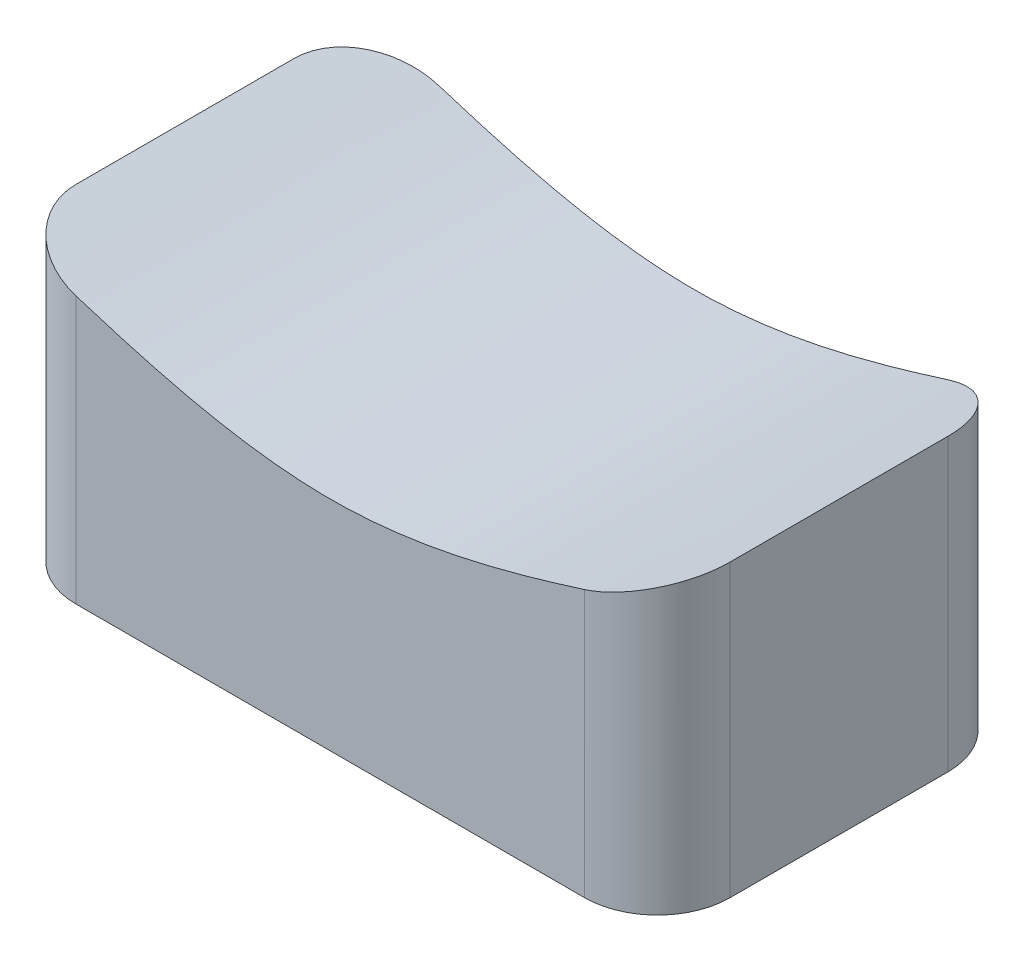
ISO-10303-21;
HEADER;
FILE_DESCRIPTION(('STEP AP214'),'2;1');
FILE_NAME('part.step','',(''),(''),'','','');
FILE_SCHEMA(('AUTOMOTIVE_DESIGN { 1 0 10303 214 1 1 1 1 }'));
ENDSEC;
DATA;
#1=APPLICATION_CONTEXT('core data for automotive mechanical design processes');
#2=APPLICATION_PROTOCOL_DEFINITION('international standard','automotive_design',2000,#1);
#3=PRODUCT_CONTEXT('',#1,'mechanical');
#4=PRODUCT('Part','Part','',(#3));
#5=PRODUCT_RELATED_PRODUCT_CATEGORY('part','',(#4));
#6=PRODUCT_DEFINITION_FORMATION('','',#4);
#7=PRODUCT_DEFINITION_CONTEXT('part definition',#1,'design');
#8=PRODUCT_DEFINITION('design','',#6,#7);
#9=PRODUCT_DEFINITION_SHAPE('','',#8);
#10=(LENGTH_UNIT() NAMED_UNIT(*) SI_UNIT(.MILLI.,.METRE.));
#11=(NAMED_UNIT(*) PLANE_ANGLE_UNIT() SI_UNIT($,.RADIAN.));
#12=(NAMED_UNIT(*) SI_UNIT($,.STERADIAN.) SOLID_ANGLE_UNIT());
#13=UNCERTAINTY_MEASURE_WITH_UNIT(LENGTH_MEASURE(1.E-05),#10,'distance_accuracy_value','');
#14=(GEOMETRIC_REPRESENTATION_CONTEXT(3) GLOBAL_UNCERTAINTY_ASSIGNED_CONTEXT((#13)) GLOBAL_UNIT_ASSIGNED_CONTEXT((#10,
#11,#12)) REPRESENTATION_CONTEXT('',''));
#15=CARTESIAN_POINT('',(0.,0.,0.));
#16=DIRECTION('',(0.,0.,1.));
#17=DIRECTION('',(1.,0.,0.));
#18=AXIS2_PLACEMENT_3D('',#15,#16,#17);
#19=CARTESIAN_POINT('',(-68.2385416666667,-80.,-29.9937499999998));
#20=DIRECTION('',(0.,1.,0.));
#21=DIRECTION('',(0.,0.,1.));
#22=AXIS2_PLACEMENT_3D('',#19,#20,#21);
#23=CYLINDRICAL_SURFACE('',#22,20.);
#24=DIRECTION('',(0.,1.,0.));
#25=VECTOR('',#24,1.);
#26=CARTESIAN_POINT('',(-88.2385416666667,-80.,-29.9937499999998));
#27=LINE('',#26,#25);
#28=CARTESIAN_POINT('',(-88.2385416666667,-80.,-29.9937499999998));
#29=VERTEX_POINT('',#28);
#30=CARTESIAN_POINT('',(-88.2385416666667,0.,-29.9937499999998));
#31=VERTEX_POINT('',#30);
#32=EDGE_CURVE('E35',#29,#31,#27,.T.);
#33=ORIENTED_EDGE('',*,*,#32,.T.);
#34=CARTESIAN_POINT('',(-88.2385416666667,0.,-29.9937499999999));
#35=CARTESIAN_POINT('',(-88.2385564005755,4.91846261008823E-06,-30.3548959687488));
#36=CARTESIAN_POINT('',(-88.2287602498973,-0.00326047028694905,-30.716039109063));
#37=CARTESIAN_POINT('',(-88.1896554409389,-0.0162954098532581,-31.43709464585));
#38=CARTESIAN_POINT('',(-88.1603497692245,-0.0260639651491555,-31.7970072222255));
#39=CARTESIAN_POINT('',(-88.0823371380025,-0.0520681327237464,-32.5144692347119));
#40=CARTESIAN_POINT('',(-88.0336311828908,-0.0683034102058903,-32.8720187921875));
#41=CARTESIAN_POINT('',(-87.9171535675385,-0.107128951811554,-33.5828529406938));
#42=CARTESIAN_POINT('',(-87.8494232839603,-0.129705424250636,-33.9361450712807));
#43=CARTESIAN_POINT('',(-87.6951293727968,-0.181135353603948,-34.6381378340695));
#44=CARTESIAN_POINT('',(-87.6085655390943,-0.209988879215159,-34.9868384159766));
#45=CARTESIAN_POINT('',(-87.4169688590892,-0.273850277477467,-35.6785321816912));
#46=CARTESIAN_POINT('',(-87.311936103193,-0.308858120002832,-36.0215253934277));
#47=CARTESIAN_POINT('',(-87.0268009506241,-0.403890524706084,-36.8705142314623));
#48=CARTESIAN_POINT('',(-86.835408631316,-0.467675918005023,-37.3723426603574));
#49=CARTESIAN_POINT('',(-86.4136331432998,-0.608222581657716,-38.3575546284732));
#50=CARTESIAN_POINT('',(-86.1832438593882,-0.684985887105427,-38.8409352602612));
#51=CARTESIAN_POINT('',(-85.8099565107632,-0.809333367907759,-39.5497313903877));
#52=CARTESIAN_POINT('',(-85.6808776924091,-0.852327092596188,-39.783335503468));
#53=CARTESIAN_POINT('',(-85.4137823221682,-0.941279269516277,-40.2447080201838));
#54=CARTESIAN_POINT('',(-85.2757683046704,-0.987236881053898,-40.4724780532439));
#55=CARTESIAN_POINT('',(-84.8486479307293,-1.12944097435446,-41.1466570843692));
#56=CARTESIAN_POINT('',(-84.5464492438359,-1.23002338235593,-41.5839615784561));
#57=CARTESIAN_POINT('',(-83.9027230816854,-1.44417268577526,-42.4407109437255));
#58=CARTESIAN_POINT('',(-83.5604820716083,-1.55797477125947,-42.8595589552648));
#59=CARTESIAN_POINT('',(-82.8448276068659,-1.79577938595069,-43.6666159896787));
#60=CARTESIAN_POINT('',(-82.4714137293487,-1.9197820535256,-44.0548245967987));
#61=CARTESIAN_POINT('',(-81.696128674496,-2.17700182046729,-44.798545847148));
#62=CARTESIAN_POINT('',(-81.2942512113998,-2.31022095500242,-45.1540512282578));
#63=CARTESIAN_POINT('',(-80.4649671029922,-2.58480086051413,-45.8304429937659));
#64=CARTESIAN_POINT('',(-80.0375599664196,-2.72616178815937,-46.1513287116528));
#65=CARTESIAN_POINT('',(-79.1385037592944,-3.02308545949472,-46.7718203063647));
#66=CARTESIAN_POINT('',(-78.6657125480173,-3.17900475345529,-47.0696015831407));
#67=CARTESIAN_POINT('',(-77.6985539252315,-3.4973658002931,-47.6238049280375));
#68=CARTESIAN_POINT('',(-77.2041850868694,-3.65980798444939,-47.8802242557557));
#69=CARTESIAN_POINT('',(-76.1972427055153,-3.98993912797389,-48.3504346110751));
#70=CARTESIAN_POINT('',(-75.6846681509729,-4.15762837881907,-48.5642232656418));
#71=CARTESIAN_POINT('',(-74.6447398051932,-4.49695617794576,-48.9481098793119));
#72=CARTESIAN_POINT('',(-74.1173878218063,-4.66859424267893,-49.1182131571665));
#73=CARTESIAN_POINT('',(-73.1489181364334,-4.98285888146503,-49.386853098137));
#74=CARTESIAN_POINT('',(-72.7096914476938,-5.12504296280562,-49.4927908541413));
#75=CARTESIAN_POINT('',(-71.8254614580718,-5.41050471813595,-49.6746468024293));
#76=CARTESIAN_POINT('',(-71.3804588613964,-5.55378225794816,-49.750568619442));
#77=CARTESIAN_POINT('',(-70.4870850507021,-5.84056350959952,-49.8720538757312));
#78=CARTESIAN_POINT('',(-70.0387192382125,-5.98406664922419,-49.9176584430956));
#79=CARTESIAN_POINT('',(-69.1398000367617,-6.27084179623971,-49.9785153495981));
#80=CARTESIAN_POINT('',(-68.6892463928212,-6.41411377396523,-49.9937640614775));
#81=CARTESIAN_POINT('',(-68.2385416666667,-6.55692729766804,-49.9937499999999));
#82=B_SPLINE_CURVE_WITH_KNOTS('',3,(#34,#35,#36,#37,#38,#39,#40,#41,#42,#43,#44,#45,#46,#47,#48,
#49,#50,#51,#52,#53,#54,#55,#56,#57,#58,#59,#60,#61,#62,#63,#64,#65,#66,#67,#68,#69,#70,#71,#72,
#73,#74,#75,#76,#77,#78,#79,#80,#81),.UNSPECIFIED.,.F.,.F.,(4,2,2,2,2,2,2,2,2,2,2,2,2,2,2,2,2,2,
2,2,2,2,2,4),(0.,1.0832858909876,2.16640598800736,3.24947001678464,4.33019645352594,
5.41093471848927,6.49166769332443,8.11228700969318,9.73316069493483,10.5439659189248,
11.3545421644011,12.9756037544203,14.6319911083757,16.2884009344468,17.945177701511,
19.6019863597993,21.3403376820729,23.0788041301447,24.8173673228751,26.5557187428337,
27.9757664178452,29.395642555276,30.8135885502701,32.231703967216),.UNSPECIFIED.);
#83=CARTESIAN_POINT('',(-68.2385416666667,-6.55692729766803,-49.9937499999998));
#84=VERTEX_POINT('',#83);
#85=EDGE_CURVE('E48',#31,#84,#82,.T.);
#86=ORIENTED_EDGE('',*,*,#85,.T.);
#87=DIRECTION('',(0.,1.,0.));
#88=VECTOR('',#87,1.);
#89=CARTESIAN_POINT('',(-68.2385416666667,-80.,-49.9937499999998));
#90=LINE('',#89,#88);
#91=CARTESIAN_POINT('',(-68.2385416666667,-80.,-49.9937499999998));
#92=VERTEX_POINT('',#91);
#93=EDGE_CURVE('E11',#92,#84,#90,.T.);
#94=ORIENTED_EDGE('',*,*,#93,.F.);
#95=CARTESIAN_POINT('',(-68.2385416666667,-80.,-29.9937499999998));
#96=DIRECTION('',(0.,1.,0.));
#97=DIRECTION('',(0.,0.,1.));
#98=AXIS2_PLACEMENT_3D('',#95,#96,#97);
#99=CIRCLE('',#98,20.);
#100=EDGE_CURVE('E118',#92,#29,#99,.T.);
#101=ORIENTED_EDGE('',*,*,#100,.T.);
#102=EDGE_LOOP('',(#33,#86,#94,#101));
#103=FACE_BOUND('',#102,.T.);
#104=ADVANCED_FACE('F31',(#103),#23,.T.);
#105=CARTESIAN_POINT('',(-68.2385416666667,-80.,-49.9937499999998));
#106=DIRECTION('',(0.,0.,-1.));
#107=DIRECTION('',(-1.,0.,0.));
#108=AXIS2_PLACEMENT_3D('',#105,#106,#107);
#109=PLANE('',#108);
#110=ORIENTED_EDGE('',*,*,#93,.T.);
#111=CARTESIAN_POINT('',(-88.2385416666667,0.,-49.9937499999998));
#112=CARTESIAN_POINT('',(-58.2385416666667,-10.,-49.9937499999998));
#113=CARTESIAN_POINT('',(1.76145833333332,-30.,-49.9937499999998));
#114=CARTESIAN_POINT('',(61.7614583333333,-10.,-49.9937499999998));
#115=CARTESIAN_POINT('',(91.7614583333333,0.,-49.9937499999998));
#116=B_SPLINE_CURVE_WITH_KNOTS('',3,(#111,#112,#113,#114,#115),.UNSPECIFIED.,.F.,.F.,(4,1,4),
(0.,0.5,1.),.UNSPECIFIED.);
#117=CARTESIAN_POINT('',(71.7614583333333,-6.55692729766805,-49.9937499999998));
#118=VERTEX_POINT('',#117);
#119=EDGE_CURVE('E54',#84,#118,#116,.T.);
#120=ORIENTED_EDGE('',*,*,#119,.T.);
#121=DIRECTION('',(0.,1.,0.));
#122=VECTOR('',#121,1.);
#123=CARTESIAN_POINT('',(71.7614583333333,-80.,-49.9937499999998));
#124=LINE('',#123,#122);
#125=CARTESIAN_POINT('',(71.7614583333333,-80.,-49.9937499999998));
#126=VERTEX_POINT('',#125);
#127=EDGE_CURVE('E40',#126,#118,#124,.T.);
#128=ORIENTED_EDGE('',*,*,#127,.F.);
#129=DIRECTION('',(-1.,0.,0.));
#130=VECTOR('',#129,1.);
#131=CARTESIAN_POINT('',(-68.2385416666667,-80.,-49.9937499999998));
#132=LINE('',#131,#130);
#133=EDGE_CURVE('E140',#126,#92,#132,.T.);
#134=ORIENTED_EDGE('',*,*,#133,.T.);
#135=EDGE_LOOP('',(#110,#120,#128,#134));
#136=FACE_BOUND('',#135,.T.);
#137=ADVANCED_FACE('F205',(#136),#109,.T.);
#138=CARTESIAN_POINT('',(71.7614583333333,-80.,-29.9937499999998));
#139=DIRECTION('',(0.,1.,0.));
#140=DIRECTION('',(0.,0.,1.));
#141=AXIS2_PLACEMENT_3D('',#138,#139,#140);
#142=CYLINDRICAL_SURFACE('',#141,20.);
#143=ORIENTED_EDGE('',*,*,#127,.T.);
#144=CARTESIAN_POINT('',(71.7614583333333,-6.55692729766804,-49.9937499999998));
#145=CARTESIAN_POINT('',(72.1521054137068,-6.43314339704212,-49.9937581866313));
#146=CARTESIAN_POINT('',(72.5426411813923,-6.30901519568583,-49.9823049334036));
#147=CARTESIAN_POINT('',(73.3223001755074,-6.06050316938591,-49.9365727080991));
#148=CARTESIAN_POINT('',(73.7114233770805,-5.93611934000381,-49.9022933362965));
#149=CARTESIAN_POINT('',(74.4870567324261,-5.68753238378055,-49.811005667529));
#150=CARTESIAN_POINT('',(74.8735668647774,-5.5633292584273,-49.7539971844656));
#151=CARTESIAN_POINT('',(75.6430422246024,-5.31546184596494,-49.6173607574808));
#152=CARTESIAN_POINT('',(76.0260048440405,-5.19179798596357,-49.5377173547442));
#153=CARTESIAN_POINT('',(76.7869245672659,-4.94554107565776,-49.3560246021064));
#154=CARTESIAN_POINT('',(77.164881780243,-4.82294800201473,-49.2539757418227));
#155=CARTESIAN_POINT('',(77.914584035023,-4.57928732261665,-49.0277297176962));
#156=CARTESIAN_POINT('',(78.286329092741,-4.45821971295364,-48.9035326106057));
#157=CARTESIAN_POINT('',(79.2069141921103,-4.15786626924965,-48.5655428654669));
#158=CARTESIAN_POINT('',(79.7511769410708,-3.9797990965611,-48.3380353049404));
#159=CARTESIAN_POINT('',(80.8191146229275,-3.62960827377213,-47.8349176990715));
#160=CARTESIAN_POINT('',(81.3427873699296,-3.45748525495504,-47.5593025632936));
#161=CARTESIAN_POINT('',(82.1095446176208,-3.20499669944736,-47.1111324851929));
#162=CARTESIAN_POINT('',(82.361984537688,-3.12178995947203,-46.9559657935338));
#163=CARTESIAN_POINT('',(82.8601190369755,-2.95746151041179,-46.6342913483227));
#164=CARTESIAN_POINT('',(83.1058154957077,-2.87633922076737,-46.467786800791));
#165=CARTESIAN_POINT('',(83.8321771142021,-2.636334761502,-45.9515227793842));
#166=CARTESIAN_POINT('',(84.3021781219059,-2.48079404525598,-45.5849757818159));
#167=CARTESIAN_POINT('',(85.199362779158,-2.18354457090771,-44.8181658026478));
#168=CARTESIAN_POINT('',(85.6272640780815,-2.0416057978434,-44.4188290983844));
#169=CARTESIAN_POINT('',(86.4481412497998,-1.76908678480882,-43.5821567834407));
#170=CARTESIAN_POINT('',(86.8411171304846,-1.6385065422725,-43.1448211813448));
#171=CARTESIAN_POINT('',(87.5886592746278,-1.38996178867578,-42.2349221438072));
#172=CARTESIAN_POINT('',(87.9432214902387,-1.27199860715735,-41.7623550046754));
#173=CARTESIAN_POINT('',(88.4435291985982,-1.10547920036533,-41.0298738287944));
#174=CARTESIAN_POINT('',(88.6050457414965,-1.05170921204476,-40.7817692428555));
#175=CARTESIAN_POINT('',(88.9172672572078,-0.947751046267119,-40.2780122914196));
#176=CARTESIAN_POINT('',(89.0679691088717,-0.897563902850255,-40.0223577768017));
#177=CARTESIAN_POINT('',(89.4886049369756,-0.757464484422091,-39.270946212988));
#178=CARTESIAN_POINT('',(89.7439119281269,-0.67240703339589,-38.7659851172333));
#179=CARTESIAN_POINT('',(90.2114740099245,-0.516614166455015,-37.7343941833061));
#180=CARTESIAN_POINT('',(90.4237315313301,-0.445877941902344,-37.2077655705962));
#181=CARTESIAN_POINT('',(90.7081659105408,-0.351081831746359,-36.4049021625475));
#182=CARTESIAN_POINT('',(90.7972922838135,-0.321376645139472,-36.1352287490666));
#183=CARTESIAN_POINT('',(90.9640574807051,-0.265793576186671,-35.5920427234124));
#184=CARTESIAN_POINT('',(91.041699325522,-0.239914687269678,-35.3185311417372));
#185=CARTESIAN_POINT('',(91.257074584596,-0.168126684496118,-34.4930971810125));
#186=CARTESIAN_POINT('',(91.3773551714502,-0.1280337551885,-33.936000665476));
#187=CARTESIAN_POINT('',(91.5693530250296,-0.0640350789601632,-32.8164587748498));
#188=CARTESIAN_POINT('',(91.6413921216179,-0.0400220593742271,-32.2540747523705));
#189=CARTESIAN_POINT('',(91.7134248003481,-0.0160111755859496,-31.4076630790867));
#190=CARTESIAN_POINT('',(91.7314313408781,-0.0100089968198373,-31.1252328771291));
#191=CARTESIAN_POINT('',(91.7554489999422,-0.00200311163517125,-30.5597969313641));
#192=CARTESIAN_POINT('',(91.7614597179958,4.61289972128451E-07,-30.2767911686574));
#193=CARTESIAN_POINT('',(91.7614583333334,0.,-29.9937499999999));
#194=B_SPLINE_CURVE_WITH_KNOTS('',3,(#144,#145,#146,#147,#148,#149,#150,#151,#152,#153,#154,
#155,#156,#157,#158,#159,#160,#161,#162,#163,#164,#165,#166,#167,#168,#169,#170,#171,#172,#173,
#174,#175,#176,#177,#178,#179,#180,#181,#182,#183,#184,#185,#186,#187,#188,#189,#190,#191,#192,
#193),.UNSPECIFIED.,.F.,.F.,(4,2,2,2,2,2,2,2,2,2,2,2,2,2,2,2,2,2,2,2,2,2,2,2,4),(0.,
1.22920602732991,2.45843358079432,3.68767119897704,4.91775036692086,6.14780265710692,
7.3778517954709,9.22411462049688,11.0705729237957,11.9936462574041,12.9164596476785,
14.7618574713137,16.5663933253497,18.3709287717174,20.1756541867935,21.0780570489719,
21.9807193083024,23.6949896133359,25.4091630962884,26.2656226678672,27.1218565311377,
28.833446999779,30.5335021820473,31.3824559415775,32.2314380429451),.UNSPECIFIED.);
#195=CARTESIAN_POINT('',(91.7614583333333,0.,-29.9937499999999));
#196=VERTEX_POINT('',#195);
#197=EDGE_CURVE('E111',#118,#196,#194,.T.);
#198=ORIENTED_EDGE('',*,*,#197,.T.);
#199=DIRECTION('',(0.,1.,0.));
#200=VECTOR('',#199,1.);
#201=CARTESIAN_POINT('',(91.7614583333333,-80.,-29.9937499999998));
#202=LINE('',#201,#200);
#203=CARTESIAN_POINT('',(91.7614583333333,-80.,-29.9937499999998));
#204=VERTEX_POINT('',#203);
#205=EDGE_CURVE('E97',#204,#196,#202,.T.);
#206=ORIENTED_EDGE('',*,*,#205,.F.);
#207=CARTESIAN_POINT('',(71.7614583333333,-80.,-29.9937499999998));
#208=DIRECTION('',(0.,1.,0.));
#209=DIRECTION('',(0.,0.,-1.));
#210=AXIS2_PLACEMENT_3D('',#207,#208,#209);
#211=CIRCLE('',#210,20.);
#212=EDGE_CURVE('E142',#204,#126,#211,.T.);
#213=ORIENTED_EDGE('',*,*,#212,.T.);
#214=EDGE_LOOP('',(#143,#198,#206,#213));
#215=FACE_BOUND('',#214,.T.);
#216=ADVANCED_FACE('F112',(#215),#142,.T.);
#217=CARTESIAN_POINT('',(71.7614583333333,-80.,30.00625));
#218=DIRECTION('',(0.,1.,0.));
#219=DIRECTION('',(0.,0.,1.));
#220=AXIS2_PLACEMENT_3D('',#217,#218,#219);
#221=CYLINDRICAL_SURFACE('',#220,20.);
#222=DIRECTION('',(0.,1.,0.));
#223=VECTOR('',#222,1.);
#224=CARTESIAN_POINT('',(91.7614583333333,-80.,30.00625));
#225=LINE('',#224,#223);
#226=CARTESIAN_POINT('',(91.7614583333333,-80.,30.00625));
#227=VERTEX_POINT('',#226);
#228=CARTESIAN_POINT('',(91.7614583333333,0.,30.00625));
#229=VERTEX_POINT('',#228);
#230=EDGE_CURVE('E108',#227,#229,#225,.T.);
#231=ORIENTED_EDGE('',*,*,#230,.T.);
#232=CARTESIAN_POINT('',(91.7614583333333,0.,30.00625));
#233=CARTESIAN_POINT('',(91.7614730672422,4.91846260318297E-06,30.367395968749));
#234=CARTESIAN_POINT('',(91.751676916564,-0.00326047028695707,30.7285391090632));
#235=CARTESIAN_POINT('',(91.7125721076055,-0.0162954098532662,31.4495946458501));
#236=CARTESIAN_POINT('',(91.6832664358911,-0.0260639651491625,31.8095072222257));
#237=CARTESIAN_POINT('',(91.6052538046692,-0.0520681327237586,32.5269692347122));
#238=CARTESIAN_POINT('',(91.5565478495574,-0.0683034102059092,32.8845187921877));
#239=CARTESIAN_POINT('',(91.4400702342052,-0.10712895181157,33.595352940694));
#240=CARTESIAN_POINT('',(91.372339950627,-0.129705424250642,33.9486450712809));
#241=CARTESIAN_POINT('',(91.2180460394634,-0.181135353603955,34.6506378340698));
#242=CARTESIAN_POINT('',(91.1314822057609,-0.209988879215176,34.9993384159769));
#243=CARTESIAN_POINT('',(90.9398855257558,-0.273850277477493,35.6910321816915));
#244=CARTESIAN_POINT('',(90.8348527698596,-0.308858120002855,36.034025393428));
#245=CARTESIAN_POINT('',(90.5497176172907,-0.403890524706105,36.8830142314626));
#246=CARTESIAN_POINT('',(90.3583252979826,-0.467675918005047,37.3848426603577));
#247=CARTESIAN_POINT('',(89.9365498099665,-0.60822258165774,38.3700546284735));
#248=CARTESIAN_POINT('',(89.7061605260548,-0.684985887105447,38.8534352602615));
#249=CARTESIAN_POINT('',(89.3328731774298,-0.809333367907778,39.562231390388));
#250=CARTESIAN_POINT('',(89.2037943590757,-0.852327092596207,39.7958355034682));
#251=CARTESIAN_POINT('',(88.9366989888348,-0.941279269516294,40.2572080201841));
#252=CARTESIAN_POINT('',(88.798684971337,-0.987236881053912,40.4849780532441));
#253=CARTESIAN_POINT('',(88.3715645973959,-1.12944097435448,41.1591570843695));
#254=CARTESIAN_POINT('',(88.0693659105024,-1.23002338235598,41.5964615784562));
#255=CARTESIAN_POINT('',(87.4256397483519,-1.44417268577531,42.4532109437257));
#256=CARTESIAN_POINT('',(87.0833987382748,-1.55797477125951,42.872058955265));
#257=CARTESIAN_POINT('',(86.3677442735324,-1.79577938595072,43.679115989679));
#258=CARTESIAN_POINT('',(85.9943303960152,-1.91978205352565,44.067324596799));
#259=CARTESIAN_POINT('',(85.2190453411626,-2.17700182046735,44.8110458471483));
#260=CARTESIAN_POINT('',(84.8171678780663,-2.31022095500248,45.1665512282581));
#261=CARTESIAN_POINT('',(83.9878837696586,-2.5848008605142,45.8429429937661));
#262=CARTESIAN_POINT('',(83.5604766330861,-2.72616178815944,46.163828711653));
#263=CARTESIAN_POINT('',(82.6614204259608,-3.0230854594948,46.7843203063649));
#264=CARTESIAN_POINT('',(82.1886292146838,-3.17900475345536,47.082101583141));
#265=CARTESIAN_POINT('',(81.221470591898,-3.49736580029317,47.6363049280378));
#266=CARTESIAN_POINT('',(80.7271017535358,-3.65980798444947,47.892724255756));
#267=CARTESIAN_POINT('',(79.7201593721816,-3.98993912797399,48.3629346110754));
#268=CARTESIAN_POINT('',(79.2075848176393,-4.15762837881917,48.576723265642));
#269=CARTESIAN_POINT('',(78.1676564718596,-4.49695617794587,48.9606098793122));
#270=CARTESIAN_POINT('',(77.6403044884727,-4.66859424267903,49.1307131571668));
#271=CARTESIAN_POINT('',(76.6718348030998,-4.98285888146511,49.3993530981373));
#272=CARTESIAN_POINT('',(76.2326081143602,-5.1250429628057,49.5052908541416));
#273=CARTESIAN_POINT('',(75.3483781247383,-5.41050471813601,49.6871468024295));
#274=CARTESIAN_POINT('',(74.9033755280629,-5.55378225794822,49.7630686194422));
#275=CARTESIAN_POINT('',(74.0100017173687,-5.84056350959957,49.8845538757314));
#276=CARTESIAN_POINT('',(73.5616359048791,-5.98406664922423,49.9301584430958));
#277=CARTESIAN_POINT('',(72.6627167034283,-6.27084179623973,49.9910153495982));
#278=CARTESIAN_POINT('',(72.2121630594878,-6.41411377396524,50.0062640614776));
#279=CARTESIAN_POINT('',(71.7614583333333,-6.55692729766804,50.00625));
#280=B_SPLINE_CURVE_WITH_KNOTS('',3,(#232,#233,#234,#235,#236,#237,#238,#239,#240,#241,#242,
#243,#244,#245,#246,#247,#248,#249,#250,#251,#252,#253,#254,#255,#256,#257,#258,#259,#260,#261,
#262,#263,#264,#265,#266,#267,#268,#269,#270,#271,#272,#273,#274,#275,#276,#277,#278,#279),
.UNSPECIFIED.,.F.,.F.,(4,2,2,2,2,2,2,2,2,2,2,2,2,2,2,2,2,2,2,2,2,2,2,4),(0.,1.08328589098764,
2.16640598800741,3.24947001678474,4.33019645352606,5.41093471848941,6.4916676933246,
8.11228700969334,9.73316069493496,10.543965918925,11.3545421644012,12.9756037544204,
14.6319911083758,16.2884009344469,17.9451777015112,19.6019863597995,21.3403376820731,
23.078804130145,24.8173673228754,26.555718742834,27.9757664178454,29.3956425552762,
30.8135885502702,32.231703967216),.UNSPECIFIED.);
#281=CARTESIAN_POINT('',(71.7614583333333,-6.55692729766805,50.00625));
#282=VERTEX_POINT('',#281);
#283=EDGE_CURVE('E114',#229,#282,#280,.T.);
#284=ORIENTED_EDGE('',*,*,#283,.T.);
#285=DIRECTION('',(0.,1.,0.));
#286=VECTOR('',#285,1.);
#287=CARTESIAN_POINT('',(71.7614583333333,-80.,50.00625));
#288=LINE('',#287,#286);
#289=CARTESIAN_POINT('',(71.7614583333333,-80.,50.00625));
#290=VERTEX_POINT('',#289);
#291=EDGE_CURVE('E130',#290,#282,#288,.T.);
#292=ORIENTED_EDGE('',*,*,#291,.F.);
#293=CARTESIAN_POINT('',(71.7614583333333,-80.,30.00625));
#294=DIRECTION('',(0.,1.,0.));
#295=DIRECTION('',(0.,0.,1.));
#296=AXIS2_PLACEMENT_3D('',#293,#294,#295);
#297=CIRCLE('',#296,20.);
#298=EDGE_CURVE('E147',#290,#227,#297,.T.);
#299=ORIENTED_EDGE('',*,*,#298,.T.);
#300=EDGE_LOOP('',(#231,#284,#292,#299));
#301=FACE_BOUND('',#300,.T.);
#302=ADVANCED_FACE('F212',(#301),#221,.T.);
#303=CARTESIAN_POINT('',(-68.2385416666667,-80.,50.00625));
#304=DIRECTION('',(0.,0.,1.));
#305=DIRECTION('',(1.,0.,0.));
#306=AXIS2_PLACEMENT_3D('',#303,#304,#305);
#307=PLANE('',#306);
#308=ORIENTED_EDGE('',*,*,#291,.T.);
#309=CARTESIAN_POINT('',(-88.2385416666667,0.,50.00625));
#310=CARTESIAN_POINT('',(-58.2385416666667,-10.,50.00625));
#311=CARTESIAN_POINT('',(1.76145833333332,-30.,50.00625));
#312=CARTESIAN_POINT('',(61.7614583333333,-10.,50.00625));
#313=CARTESIAN_POINT('',(91.7614583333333,0.,50.00625));
#314=B_SPLINE_CURVE_WITH_KNOTS('',3,(#309,#310,#311,#312,#313),.UNSPECIFIED.,.F.,.F.,(4,1,4),
(0.,0.5,1.),.UNSPECIFIED.);
#315=CARTESIAN_POINT('',(-68.2385416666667,-6.55692729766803,50.00625));
#316=VERTEX_POINT('',#315);
#317=EDGE_CURVE('E185',#282,#316,#314,.F.);
#318=ORIENTED_EDGE('',*,*,#317,.T.);
#319=DIRECTION('',(0.,1.,0.));
#320=VECTOR('',#319,1.);
#321=CARTESIAN_POINT('',(-68.2385416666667,-80.,50.00625));
#322=LINE('',#321,#320);
#323=CARTESIAN_POINT('',(-68.2385416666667,-80.,50.00625));
#324=VERTEX_POINT('',#323);
#325=EDGE_CURVE('E133',#324,#316,#322,.T.);
#326=ORIENTED_EDGE('',*,*,#325,.F.);
#327=DIRECTION('',(1.,0.,0.));
#328=VECTOR('',#327,1.);
#329=CARTESIAN_POINT('',(-68.2385416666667,-80.,50.00625));
#330=LINE('',#329,#328);
#331=EDGE_CURVE('E150',#324,#290,#330,.T.);
#332=ORIENTED_EDGE('',*,*,#331,.T.);
#333=EDGE_LOOP('',(#308,#318,#326,#332));
#334=FACE_BOUND('',#333,.T.);
#335=ADVANCED_FACE('F193',(#334),#307,.T.);
#336=CARTESIAN_POINT('',(-68.2385416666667,-80.,30.00625));
#337=DIRECTION('',(0.,1.,0.));
#338=DIRECTION('',(0.,0.,1.));
#339=AXIS2_PLACEMENT_3D('',#336,#337,#338);
#340=CYLINDRICAL_SURFACE('',#339,20.);
#341=ORIENTED_EDGE('',*,*,#325,.T.);
#342=CARTESIAN_POINT('',(-68.2385416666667,-6.55692729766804,50.00625));
#343=CARTESIAN_POINT('',(-68.6291887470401,-6.43314339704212,50.0062581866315));
#344=CARTESIAN_POINT('',(-69.0197245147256,-6.30901519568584,49.9948049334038));
#345=CARTESIAN_POINT('',(-69.7993835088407,-6.06050316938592,49.9490727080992));
#346=CARTESIAN_POINT('',(-70.1885067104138,-5.93611934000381,49.9147933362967));
#347=CARTESIAN_POINT('',(-70.9641400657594,-5.68753238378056,49.8235056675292));
#348=CARTESIAN_POINT('',(-71.3506501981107,-5.5633292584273,49.7664971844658));
#349=CARTESIAN_POINT('',(-72.1201255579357,-5.31546184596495,49.629860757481));
#350=CARTESIAN_POINT('',(-72.5030881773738,-5.19179798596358,49.5502173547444));
#351=CARTESIAN_POINT('',(-73.2640079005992,-4.94554107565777,49.3685246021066));
#352=CARTESIAN_POINT('',(-73.6419651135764,-4.82294800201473,49.2664757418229));
#353=CARTESIAN_POINT('',(-74.3916673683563,-4.57928732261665,49.0402297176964));
#354=CARTESIAN_POINT('',(-74.7634124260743,-4.45821971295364,48.9160326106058));
#355=CARTESIAN_POINT('',(-75.6839975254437,-4.15786626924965,48.578042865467));
#356=CARTESIAN_POINT('',(-76.2282602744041,-3.97979909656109,48.3505353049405));
#357=CARTESIAN_POINT('',(-77.2961979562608,-3.62960827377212,47.8474176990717));
#358=CARTESIAN_POINT('',(-77.8198707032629,-3.45748525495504,47.5718025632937));
#359=CARTESIAN_POINT('',(-78.5866279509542,-3.20499669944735,47.1236324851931));
#360=CARTESIAN_POINT('',(-78.8390678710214,-3.12178995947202,46.968465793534));
#361=CARTESIAN_POINT('',(-79.3372023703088,-2.95746151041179,46.6467913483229));
#362=CARTESIAN_POINT('',(-79.5828988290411,-2.87633922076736,46.4802868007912));
#363=CARTESIAN_POINT('',(-80.3092604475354,-2.63633476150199,45.9640227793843));
#364=CARTESIAN_POINT('',(-80.7792614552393,-2.48079404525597,45.5974757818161));
#365=CARTESIAN_POINT('',(-81.6764461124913,-2.1835445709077,44.8306658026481));
#366=CARTESIAN_POINT('',(-82.1043474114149,-2.0416057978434,44.4313290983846));
#367=CARTESIAN_POINT('',(-82.9252245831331,-1.76908678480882,43.5946567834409));
#368=CARTESIAN_POINT('',(-83.3182004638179,-1.63850654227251,43.157321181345));
#369=CARTESIAN_POINT('',(-84.0657426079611,-1.38996178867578,42.2474221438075));
#370=CARTESIAN_POINT('',(-84.420304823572,-1.27199860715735,41.7748550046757));
#371=CARTESIAN_POINT('',(-84.9206125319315,-1.10547920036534,41.0423738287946));
#372=CARTESIAN_POINT('',(-85.0821290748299,-1.05170921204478,40.7942692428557));
#373=CARTESIAN_POINT('',(-85.3943505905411,-0.947751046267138,40.2905122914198));
#374=CARTESIAN_POINT('',(-85.545052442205,-0.897563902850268,40.0348577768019));
#375=CARTESIAN_POINT('',(-85.9656882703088,-0.757464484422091,39.2834462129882));
#376=CARTESIAN_POINT('',(-86.2209952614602,-0.672407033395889,38.7784851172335));
#377=CARTESIAN_POINT('',(-86.6885573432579,-0.516614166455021,37.7468941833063));
#378=CARTESIAN_POINT('',(-86.9008148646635,-0.445877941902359,37.2202655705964));
#379=CARTESIAN_POINT('',(-87.1852492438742,-0.351081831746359,36.4174021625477));
#380=CARTESIAN_POINT('',(-87.2743756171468,-0.321376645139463,36.1477287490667));
#381=CARTESIAN_POINT('',(-87.4411408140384,-0.265793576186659,35.6045427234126));
#382=CARTESIAN_POINT('',(-87.5187826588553,-0.239914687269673,35.3310311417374));
#383=CARTESIAN_POINT('',(-87.7341579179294,-0.168126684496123,34.5055971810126));
#384=CARTESIAN_POINT('',(-87.8544385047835,-0.128033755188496,33.9485006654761));
#385=CARTESIAN_POINT('',(-88.0464363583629,-0.0640350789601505,32.82895877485));
#386=CARTESIAN_POINT('',(-88.1184754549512,-0.0400220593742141,32.2665747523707));
#387=CARTESIAN_POINT('',(-88.1905081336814,-0.0160111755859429,31.4201630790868));
#388=CARTESIAN_POINT('',(-88.2085146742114,-0.0100089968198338,31.1377328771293));
#389=CARTESIAN_POINT('',(-88.2325323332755,-0.00200311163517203,30.5722969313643));
#390=CARTESIAN_POINT('',(-88.2385430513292,4.61289970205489E-07,30.2892911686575));
#391=CARTESIAN_POINT('',(-88.2385416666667,0.,30.00625));
#392=B_SPLINE_CURVE_WITH_KNOTS('',3,(#342,#343,#344,#345,#346,#347,#348,#349,#350,#351,#352,
#353,#354,#355,#356,#357,#358,#359,#360,#361,#362,#363,#364,#365,#366,#367,#368,#369,#370,#371,
#372,#373,#374,#375,#376,#377,#378,#379,#380,#381,#382,#383,#384,#385,#386,#387,#388,#389,#390,
#391),.UNSPECIFIED.,.F.,.F.,(4,2,2,2,2,2,2,2,2,2,2,2,2,2,2,2,2,2,2,2,2,2,2,2,4),(0.,
1.22920602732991,2.45843358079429,3.68767119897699,4.91775036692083,6.14780265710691,
7.3778517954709,9.22411462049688,11.0705729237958,11.9936462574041,12.9164596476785,
14.7618574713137,16.5663933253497,18.3709287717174,20.1756541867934,21.0780570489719,
21.9807193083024,23.6949896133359,25.4091630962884,26.2656226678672,27.1218565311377,
28.833446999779,30.5335021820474,31.3824559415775,32.2314380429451),.UNSPECIFIED.);
#393=CARTESIAN_POINT('',(-88.2385416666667,0.,30.00625));
#394=VERTEX_POINT('',#393);
#395=EDGE_CURVE('E176',#316,#394,#392,.T.);
#396=ORIENTED_EDGE('',*,*,#395,.T.);
#397=DIRECTION('',(0.,1.,0.));
#398=VECTOR('',#397,1.);
#399=CARTESIAN_POINT('',(-88.2385416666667,-80.,30.00625));
#400=LINE('',#399,#398);
#401=CARTESIAN_POINT('',(-88.2385416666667,-80.,30.00625));
#402=VERTEX_POINT('',#401);
#403=EDGE_CURVE('E135',#402,#394,#400,.T.);
#404=ORIENTED_EDGE('',*,*,#403,.F.);
#405=CARTESIAN_POINT('',(-68.2385416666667,-80.,30.00625));
#406=DIRECTION('',(0.,1.,0.));
#407=DIRECTION('',(0.,0.,1.));
#408=AXIS2_PLACEMENT_3D('',#405,#406,#407);
#409=CIRCLE('',#408,20.);
#410=EDGE_CURVE('E153',#402,#324,#409,.T.);
#411=ORIENTED_EDGE('',*,*,#410,.T.);
#412=EDGE_LOOP('',(#341,#396,#404,#411));
#413=FACE_BOUND('',#412,.T.);
#414=ADVANCED_FACE('F189',(#413),#340,.T.);
#415=CARTESIAN_POINT('',(91.7614583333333,-80.,-29.9937499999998));
#416=DIRECTION('',(1.,0.,0.));
#417=DIRECTION('',(0.,0.,-1.));
#418=AXIS2_PLACEMENT_3D('',#415,#416,#417);
#419=PLANE('',#418);
#420=DIRECTION('',(0.,0.,-1.));
#421=VECTOR('',#420,1.);
#422=CARTESIAN_POINT('',(91.7614583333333,0.,-29.9937499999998));
#423=LINE('',#422,#421);
#424=EDGE_CURVE('E101',#229,#196,#423,.T.);
#425=ORIENTED_EDGE('',*,*,#424,.F.);
#426=ORIENTED_EDGE('',*,*,#230,.F.);
#427=DIRECTION('',(0.,0.,-1.));
#428=VECTOR('',#427,1.);
#429=CARTESIAN_POINT('',(91.7614583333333,-80.,-29.9937499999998));
#430=LINE('',#429,#428);
#431=EDGE_CURVE('E104',#227,#204,#430,.T.);
#432=ORIENTED_EDGE('',*,*,#431,.T.);
#433=ORIENTED_EDGE('',*,*,#205,.T.);
#434=EDGE_LOOP('',(#425,#426,#432,#433));
#435=FACE_BOUND('',#434,.T.);
#436=ADVANCED_FACE('F99',(#435),#419,.T.);
#437=CARTESIAN_POINT('',(-88.2385416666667,-80.,-29.9937499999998));
#438=DIRECTION('',(-1.,0.,0.));
#439=DIRECTION('',(0.,0.,1.));
#440=AXIS2_PLACEMENT_3D('',#437,#438,#439);
#441=PLANE('',#440);
#442=DIRECTION('',(0.,0.,1.));
#443=VECTOR('',#442,1.);
#444=CARTESIAN_POINT('',(-88.2385416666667,0.,-29.9937499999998));
#445=LINE('',#444,#443);
#446=EDGE_CURVE('E119',#31,#394,#445,.T.);
#447=ORIENTED_EDGE('',*,*,#446,.F.);
#448=ORIENTED_EDGE('',*,*,#32,.F.);
#449=DIRECTION('',(0.,0.,1.));
#450=VECTOR('',#449,1.);
#451=CARTESIAN_POINT('',(-88.2385416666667,-80.,-29.9937499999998));
#452=LINE('',#451,#450);
#453=EDGE_CURVE('E122',#29,#402,#452,.T.);
#454=ORIENTED_EDGE('',*,*,#453,.T.);
#455=ORIENTED_EDGE('',*,*,#403,.T.);
#456=EDGE_LOOP('',(#447,#448,#454,#455));
#457=FACE_BOUND('',#456,.T.);
#458=ADVANCED_FACE('F196',(#457),#441,.T.);
#459=CARTESIAN_POINT('',(-68.2385416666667,-80.,-29.9937499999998));
#460=DIRECTION('',(0.,1.,0.));
#461=DIRECTION('',(0.,0.,1.));
#462=AXIS2_PLACEMENT_3D('',#459,#460,#461);
#463=PLANE('',#462);
#464=ORIENTED_EDGE('',*,*,#100,.F.);
#465=ORIENTED_EDGE('',*,*,#133,.F.);
#466=ORIENTED_EDGE('',*,*,#212,.F.);
#467=ORIENTED_EDGE('',*,*,#431,.F.);
#468=ORIENTED_EDGE('',*,*,#298,.F.);
#469=ORIENTED_EDGE('',*,*,#331,.F.);
#470=ORIENTED_EDGE('',*,*,#410,.F.);
#471=ORIENTED_EDGE('',*,*,#453,.F.);
#472=EDGE_LOOP('',(#464,#465,#466,#467,#468,#469,#470,#471));
#473=FACE_BOUND('',#472,.T.);
#474=ADVANCED_FACE('F168',(#473),#463,.F.);
#475=CARTESIAN_POINT('',(-88.2385416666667,0.,338.626212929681));
#476=CARTESIAN_POINT('',(-58.2385416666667,-10.,338.626212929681));
#477=CARTESIAN_POINT('',(1.76145833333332,-30.,338.626212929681));
#478=CARTESIAN_POINT('',(61.7614583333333,-10.,338.626212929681));
#479=CARTESIAN_POINT('',(91.7614583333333,0.,338.626212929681));
#480=B_SPLINE_CURVE_WITH_KNOTS('',3,(#475,#476,#477,#478,#479),.UNSPECIFIED.,.F.,.F.,(4,1,4),
(0.,0.5,1.),.UNSPECIFIED.);
#481=DIRECTION('',(0.,0.,-1.));
#482=VECTOR('',#481,1.);
#483=SURFACE_OF_LINEAR_EXTRUSION('',#480,#482);
#484=ORIENTED_EDGE('',*,*,#85,.F.);
#485=ORIENTED_EDGE('',*,*,#446,.T.);
#486=ORIENTED_EDGE('',*,*,#395,.F.);
#487=ORIENTED_EDGE('',*,*,#317,.F.);
#488=ORIENTED_EDGE('',*,*,#283,.F.);
#489=ORIENTED_EDGE('',*,*,#424,.T.);
#490=ORIENTED_EDGE('',*,*,#197,.F.);
#491=ORIENTED_EDGE('',*,*,#119,.F.);
#492=EDGE_LOOP('',(#484,#485,#486,#487,#488,#489,#490,#491));
#493=FACE_BOUND('',#492,.T.);
#494=ADVANCED_FACE('F116',(#493),#483,.T.);
#495=CLOSED_SHELL('',(#104,#137,#216,#302,#335,#414,#436,#458,#474,#494));
#496=MANIFOLD_SOLID_BREP('B2',#495);
#497=ADVANCED_BREP_SHAPE_REPRESENTATION('',(#18,#496),#14);
#498=SHAPE_DEFINITION_REPRESENTATION(#9,#497);
ENDSEC;
END-ISO-10303-21;
